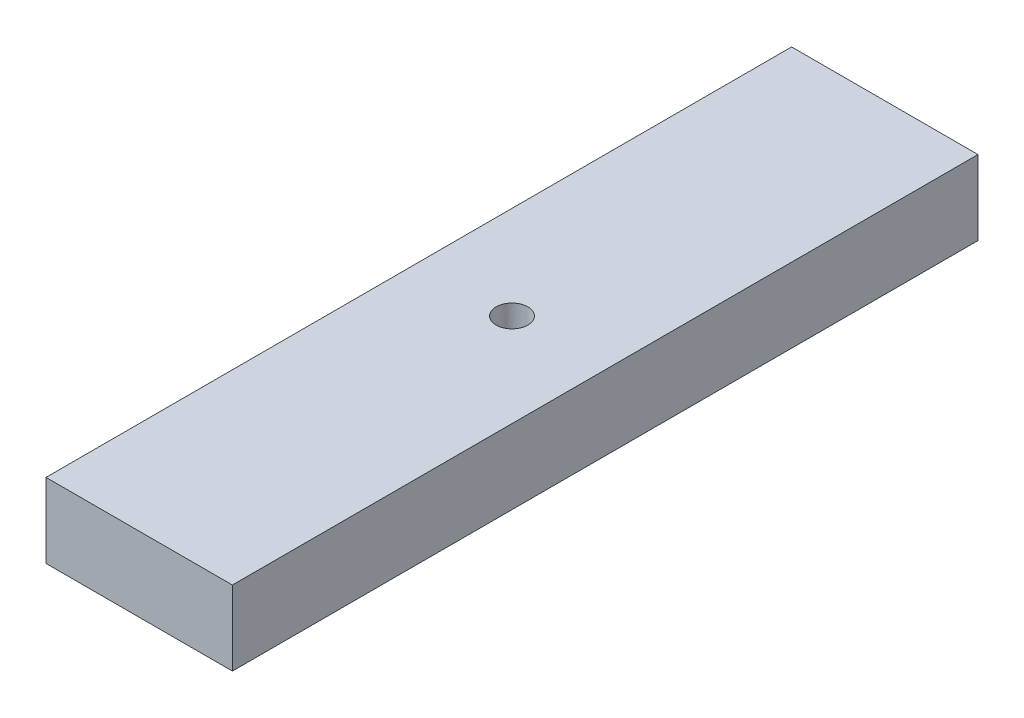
ISO-10303-21;
HEADER;
FILE_DESCRIPTION(('STEP AP214'),'2;1');
FILE_NAME('part.step','',(''),(''),'','','');
FILE_SCHEMA(('AUTOMOTIVE_DESIGN { 1 0 10303 214 1 1 1 1 }'));
ENDSEC;
DATA;
#1=APPLICATION_CONTEXT('core data for automotive mechanical design processes');
#2=APPLICATION_PROTOCOL_DEFINITION('international standard','automotive_design',2000,#1);
#3=PRODUCT_CONTEXT('',#1,'mechanical');
#4=PRODUCT('Part','Part','',(#3));
#5=PRODUCT_RELATED_PRODUCT_CATEGORY('part','',(#4));
#6=PRODUCT_DEFINITION_FORMATION('','',#4);
#7=PRODUCT_DEFINITION_CONTEXT('part definition',#1,'design');
#8=PRODUCT_DEFINITION('design','',#6,#7);
#9=PRODUCT_DEFINITION_SHAPE('','',#8);
#10=(LENGTH_UNIT() NAMED_UNIT(*) SI_UNIT(.MILLI.,.METRE.));
#11=(NAMED_UNIT(*) PLANE_ANGLE_UNIT() SI_UNIT($,.RADIAN.));
#12=(NAMED_UNIT(*) SI_UNIT($,.STERADIAN.) SOLID_ANGLE_UNIT());
#13=UNCERTAINTY_MEASURE_WITH_UNIT(LENGTH_MEASURE(1.E-05),#10,'distance_accuracy_value','');
#14=(GEOMETRIC_REPRESENTATION_CONTEXT(3) GLOBAL_UNCERTAINTY_ASSIGNED_CONTEXT((#13)) GLOBAL_UNIT_ASSIGNED_CONTEXT((#10,
#11,#12)) REPRESENTATION_CONTEXT('',''));
#15=CARTESIAN_POINT('',(0.,0.,0.));
#16=DIRECTION('',(0.,0.,1.));
#17=DIRECTION('',(1.,0.,0.));
#18=AXIS2_PLACEMENT_3D('',#15,#16,#17);
#19=CARTESIAN_POINT('',(-25.,0.,-100.));
#20=DIRECTION('',(-1.,0.,0.));
#21=DIRECTION('',(0.,-1.,0.));
#22=AXIS2_PLACEMENT_3D('',#19,#20,#21);
#23=PLANE('',#22);
#24=DIRECTION('',(0.,0.,1.));
#25=VECTOR('',#24,1.);
#26=CARTESIAN_POINT('',(-25.,-20.,-100.));
#27=LINE('',#26,#25);
#28=CARTESIAN_POINT('',(-25.,-20.,-100.));
#29=VERTEX_POINT('',#28);
#30=CARTESIAN_POINT('',(-25.,-20.,100.));
#31=VERTEX_POINT('',#30);
#32=EDGE_CURVE('E33',#29,#31,#27,.T.);
#33=ORIENTED_EDGE('',*,*,#32,.T.);
#34=DIRECTION('',(0.,-1.,0.));
#35=VECTOR('',#34,1.);
#36=CARTESIAN_POINT('',(-25.,0.,100.));
#37=LINE('',#36,#35);
#38=CARTESIAN_POINT('',(-25.,0.,100.));
#39=VERTEX_POINT('',#38);
#40=EDGE_CURVE('E70',#39,#31,#37,.T.);
#41=ORIENTED_EDGE('',*,*,#40,.F.);
#42=DIRECTION('',(0.,0.,1.));
#43=VECTOR('',#42,1.);
#44=CARTESIAN_POINT('',(-25.,0.,-100.));
#45=LINE('',#44,#43);
#46=CARTESIAN_POINT('',(-25.,0.,-100.));
#47=VERTEX_POINT('',#46);
#48=EDGE_CURVE('E11',#47,#39,#45,.T.);
#49=ORIENTED_EDGE('',*,*,#48,.F.);
#50=DIRECTION('',(0.,-1.,0.));
#51=VECTOR('',#50,1.);
#52=CARTESIAN_POINT('',(-25.,0.,-100.));
#53=LINE('',#52,#51);
#54=EDGE_CURVE('E71',#47,#29,#53,.T.);
#55=ORIENTED_EDGE('',*,*,#54,.T.);
#56=EDGE_LOOP('',(#33,#41,#49,#55));
#57=FACE_BOUND('',#56,.T.);
#58=ADVANCED_FACE('F30',(#57),#23,.T.);
#59=CARTESIAN_POINT('',(-25.,0.,-100.));
#60=DIRECTION('',(0.,1.,0.));
#61=DIRECTION('',(0.,0.,1.));
#62=AXIS2_PLACEMENT_3D('',#59,#60,#61);
#63=PLANE('',#62);
#64=CARTESIAN_POINT('',(0.,0.,0.));
#65=DIRECTION('',(0.,1.,0.));
#66=DIRECTION('',(0.,0.,1.));
#67=AXIS2_PLACEMENT_3D('',#64,#65,#66);
#68=CIRCLE('',#67,4.25);
#69=CARTESIAN_POINT('',(0.,0.,4.25));
#70=VERTEX_POINT('',#69);
#71=EDGE_CURVE('E91',#70,#70,#68,.T.);
#72=ORIENTED_EDGE('',*,*,#71,.F.);
#73=EDGE_LOOP('',(#72));
#74=FACE_BOUND('',#73,.T.);
#75=ORIENTED_EDGE('',*,*,#48,.T.);
#76=DIRECTION('',(-1.,0.,0.));
#77=VECTOR('',#76,1.);
#78=CARTESIAN_POINT('',(-25.,0.,100.));
#79=LINE('',#78,#77);
#80=CARTESIAN_POINT('',(25.,0.,100.));
#81=VERTEX_POINT('',#80);
#82=EDGE_CURVE('E87',#81,#39,#79,.T.);
#83=ORIENTED_EDGE('',*,*,#82,.F.);
#84=DIRECTION('',(0.,0.,1.));
#85=VECTOR('',#84,1.);
#86=CARTESIAN_POINT('',(25.,0.,-100.));
#87=LINE('',#86,#85);
#88=CARTESIAN_POINT('',(25.,0.,-100.));
#89=VERTEX_POINT('',#88);
#90=EDGE_CURVE('E38',#89,#81,#87,.T.);
#91=ORIENTED_EDGE('',*,*,#90,.F.);
#92=DIRECTION('',(-1.,0.,0.));
#93=VECTOR('',#92,1.);
#94=CARTESIAN_POINT('',(-25.,0.,-100.));
#95=LINE('',#94,#93);
#96=EDGE_CURVE('E76',#89,#47,#95,.T.);
#97=ORIENTED_EDGE('',*,*,#96,.T.);
#98=EDGE_LOOP('',(#75,#83,#91,#97));
#99=FACE_BOUND('',#98,.T.);
#100=ADVANCED_FACE('F107',(#74,#99),#63,.T.);
#101=CARTESIAN_POINT('',(25.,0.,-100.));
#102=DIRECTION('',(1.,0.,0.));
#103=DIRECTION('',(0.,0.,-1.));
#104=AXIS2_PLACEMENT_3D('',#101,#102,#103);
#105=PLANE('',#104);
#106=ORIENTED_EDGE('',*,*,#90,.T.);
#107=DIRECTION('',(0.,1.,0.));
#108=VECTOR('',#107,1.);
#109=CARTESIAN_POINT('',(25.,0.,100.));
#110=LINE('',#109,#108);
#111=CARTESIAN_POINT('',(25.,-20.,100.));
#112=VERTEX_POINT('',#111);
#113=EDGE_CURVE('E83',#112,#81,#110,.T.);
#114=ORIENTED_EDGE('',*,*,#113,.F.);
#115=DIRECTION('',(0.,0.,1.));
#116=VECTOR('',#115,1.);
#117=CARTESIAN_POINT('',(25.,-20.,-100.));
#118=LINE('',#117,#116);
#119=CARTESIAN_POINT('',(25.,-20.,-100.));
#120=VERTEX_POINT('',#119);
#121=EDGE_CURVE('E75',#120,#112,#118,.T.);
#122=ORIENTED_EDGE('',*,*,#121,.F.);
#123=DIRECTION('',(0.,1.,0.));
#124=VECTOR('',#123,1.);
#125=CARTESIAN_POINT('',(25.,0.,-100.));
#126=LINE('',#125,#124);
#127=EDGE_CURVE('E100',#120,#89,#126,.T.);
#128=ORIENTED_EDGE('',*,*,#127,.T.);
#129=EDGE_LOOP('',(#106,#114,#122,#128));
#130=FACE_BOUND('',#129,.T.);
#131=ADVANCED_FACE('F104',(#130),#105,.T.);
#132=CARTESIAN_POINT('',(-25.,-20.,-100.));
#133=DIRECTION('',(0.,-1.,0.));
#134=DIRECTION('',(0.,0.,-1.));
#135=AXIS2_PLACEMENT_3D('',#132,#133,#134);
#136=PLANE('',#135);
#137=CARTESIAN_POINT('',(0.,-20.,0.));
#138=DIRECTION('',(0.,1.,0.));
#139=DIRECTION('',(0.,0.,1.));
#140=AXIS2_PLACEMENT_3D('',#137,#138,#139);
#141=CIRCLE('',#140,4.25);
#142=CARTESIAN_POINT('',(0.,-20.,4.25));
#143=VERTEX_POINT('',#142);
#144=EDGE_CURVE('E88',#143,#143,#141,.T.);
#145=ORIENTED_EDGE('',*,*,#144,.T.);
#146=EDGE_LOOP('',(#145));
#147=FACE_BOUND('',#146,.T.);
#148=ORIENTED_EDGE('',*,*,#121,.T.);
#149=DIRECTION('',(1.,0.,0.));
#150=VECTOR('',#149,1.);
#151=CARTESIAN_POINT('',(-25.,-20.,100.));
#152=LINE('',#151,#150);
#153=EDGE_CURVE('E78',#31,#112,#152,.T.);
#154=ORIENTED_EDGE('',*,*,#153,.F.);
#155=ORIENTED_EDGE('',*,*,#32,.F.);
#156=DIRECTION('',(1.,0.,0.));
#157=VECTOR('',#156,1.);
#158=CARTESIAN_POINT('',(-25.,-20.,-100.));
#159=LINE('',#158,#157);
#160=EDGE_CURVE('E98',#29,#120,#159,.T.);
#161=ORIENTED_EDGE('',*,*,#160,.T.);
#162=EDGE_LOOP('',(#148,#154,#155,#161));
#163=FACE_BOUND('',#162,.T.);
#164=ADVANCED_FACE('F79',(#147,#163),#136,.T.);
#165=CARTESIAN_POINT('',(-25.,-20.,-100.));
#166=DIRECTION('',(0.,0.,1.));
#167=DIRECTION('',(1.,0.,0.));
#168=AXIS2_PLACEMENT_3D('',#165,#166,#167);
#169=PLANE('',#168);
#170=ORIENTED_EDGE('',*,*,#54,.F.);
#171=ORIENTED_EDGE('',*,*,#96,.F.);
#172=ORIENTED_EDGE('',*,*,#127,.F.);
#173=ORIENTED_EDGE('',*,*,#160,.F.);
#174=EDGE_LOOP('',(#170,#171,#172,#173));
#175=FACE_BOUND('',#174,.T.);
#176=ADVANCED_FACE('F109',(#175),#169,.F.);
#177=CARTESIAN_POINT('',(-25.,-20.,100.));
#178=DIRECTION('',(0.,0.,1.));
#179=DIRECTION('',(1.,0.,0.));
#180=AXIS2_PLACEMENT_3D('',#177,#178,#179);
#181=PLANE('',#180);
#182=ORIENTED_EDGE('',*,*,#40,.T.);
#183=ORIENTED_EDGE('',*,*,#153,.T.);
#184=ORIENTED_EDGE('',*,*,#113,.T.);
#185=ORIENTED_EDGE('',*,*,#82,.T.);
#186=EDGE_LOOP('',(#182,#183,#184,#185));
#187=FACE_BOUND('',#186,.T.);
#188=ADVANCED_FACE('F86',(#187),#181,.T.);
#189=CARTESIAN_POINT('',(0.,-20.,0.));
#190=DIRECTION('',(0.,1.,0.));
#191=DIRECTION('',(0.,0.,1.));
#192=AXIS2_PLACEMENT_3D('',#189,#190,#191);
#193=CYLINDRICAL_SURFACE('',#192,4.25);
#194=ORIENTED_EDGE('',*,*,#144,.F.);
#195=EDGE_LOOP('',(#194));
#196=FACE_BOUND('',#195,.T.);
#197=ORIENTED_EDGE('',*,*,#71,.T.);
#198=EDGE_LOOP('',(#197));
#199=FACE_BOUND('',#198,.T.);
#200=ADVANCED_FACE('F116',(#196,#199),#193,.F.);
#201=CLOSED_SHELL('',(#58,#100,#131,#164,#176,#188,#200));
#202=MANIFOLD_SOLID_BREP('B2',#201);
#203=ADVANCED_BREP_SHAPE_REPRESENTATION('',(#18,#202),#14);
#204=SHAPE_DEFINITION_REPRESENTATION(#9,#203);
ENDSEC;
END-ISO-10303-21;
